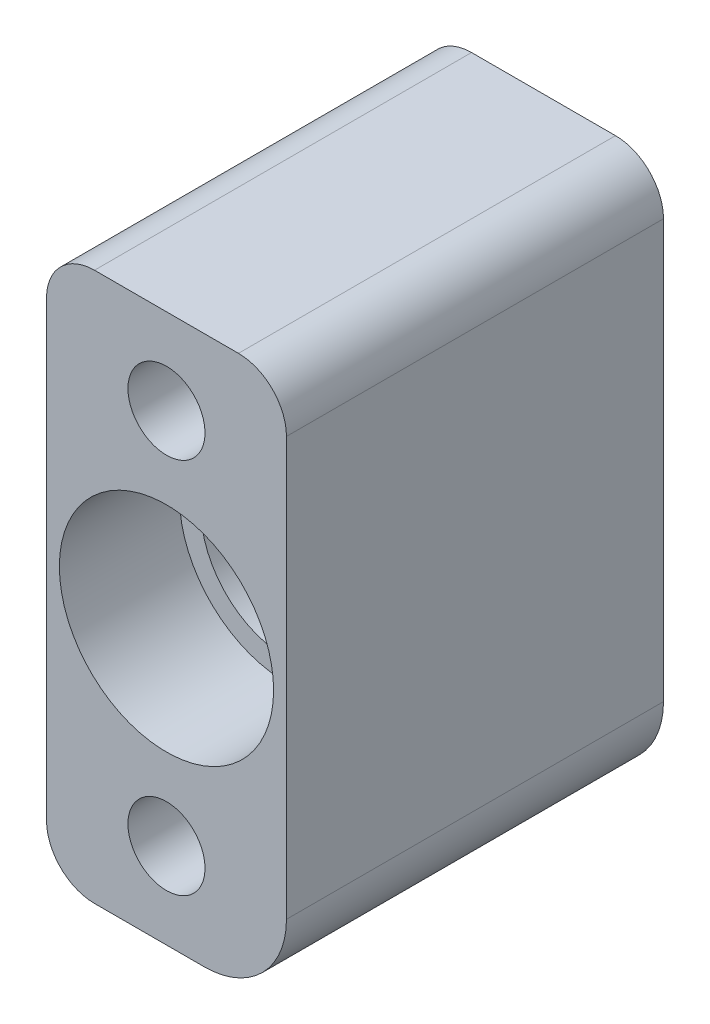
from build123d import *

# Parameters (mm, degrees)
BOSS_EXTRUDE1_DEPTH = 31.75
HOLE1_D             = 15.875
HOLE1_CBORE_D       = 19.84375
HOLE1_CBORE_DEPTH   = 11.1252
HOLE11_D            = 7.1374
HOLE11_CBORE_D      = 10.7188
HOLE11_CBORE_DEPTH  = 9.652
MOVE_FACE1_BY       = 3.175


with BuildPart() as part:
    # Sketch1 → Boss-Extrude1 (new body)
    with BuildSketch(Plane(origin=(0, 0, 40.2082), x_dir=(-1, 0, 0), z_dir=(0, 0, -1))):
        with BuildLine():
            Line((754.411295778, -5.550406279), (767.746295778, -5.550406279))
            ThreePointArc((767.746295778, -5.550406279), (770.889385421, -6.852316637), (772.191295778, -9.995406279))
            Line((772.191295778, -9.995406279), (772.191295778, -51.905406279))
            ThreePointArc((772.191295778, -51.905406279), (770.889385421, -55.048495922), (767.746295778, -56.350406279))
            Line((767.746295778, -56.350406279), (757.586295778, -56.350406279))
            ThreePointArc((757.586295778, -56.350406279), (752.198142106, -54.118559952), (749.966295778, -48.730406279))
            Line((749.966295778, -48.730406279), (749.966295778, -9.995406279))
            ThreePointArc((749.966295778, -9.995406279), (751.268206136, -6.852316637), (754.411295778, -5.550406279))
        make_face()
    extrude(amount=-BOSS_EXTRUDE1_DEPTH)

    # Hole1 (through all)
    with Locations(Plane(origin=(-773.947902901, -30.015406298, 71.9582), x_dir=(1, 0, 0), z_dir=(0, 0, 1))):
        with Locations((12.869107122, -0.934999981)):
            CounterBoreHole(HOLE1_D / 2, HOLE1_CBORE_D / 2, HOLE1_CBORE_DEPTH)

    # Hole11 (through all)
    with Locations(Plane(origin=(-748.209688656, -15.727906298, 40.2082), x_dir=(-1, 0, 0), z_dir=(0, 0, -1))):
        with Locations((12.869107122, 2.240000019), (12.869107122, -32.684999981)):
            CounterBoreHole(HOLE11_D / 2, HOLE11_CBORE_D / 2, HOLE11_CBORE_DEPTH)

    # Move Face1: a face moved outward by 3.175
    extrude(part.faces().sort_by_distance((-766.635045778, -43.650406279, 40.2082))[0], amount=MOVE_FACE1_BY, dir=(0, 0, -1))


solid = part.part
